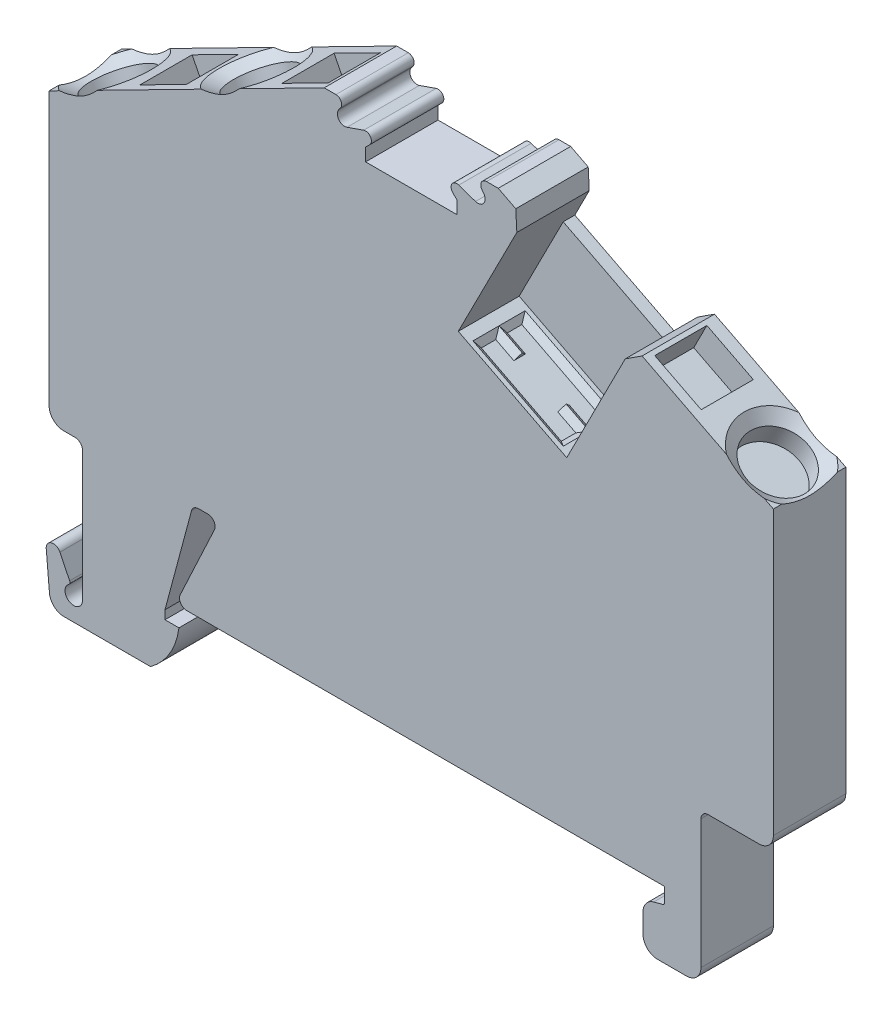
from build123d import *

# Parameters (mm, degrees)
BOSS_EXTRUDE1_DEPTH     = 5
BOSS_EXTRUDE2_DEPTH     = 5
BOSS_EXTRUDE3_DEPTH     = 0.8
CUT_EXTRUDE1_DEPTH      = 3.6
CUT_EXTRUDE2_DEPTH      = 3.6
CUT_EXTRUDE3_DEPTH      = 3.6
CUT_EXTRUDE4_DEPTH      = 3.5
CUT_EXTRUDE4_DEPTH_BACK = 3.5
CUT_EXTRUDE5_DEPTH      = 1.7
CUT_EXTRUDE5_DEPTH_BACK = 1.7
SKETCH11_W              = 1
SKETCH11_H              = 0.4
BOSS_EXTRUDE4_DEPTH     = 5


with BuildPart() as part:
    # Sketch1 → Boss-Extrude1 (new body)
    with BuildSketch(Plane.XY):
        with BuildLine():
            Line((-25, 10), (25, 10))
            Line((25, 10), (25, 26.322216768))
            Line((25, 26.322216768), (15.936493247, 30.940304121))
            Line((15.936493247, 30.940304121), (14.774397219, 30.185630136))
            Line((14.774397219, 30.185630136), (10.733881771, 22.255672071))
            Line((10.733881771, 22.255672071), (3.249426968, 26.069192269))
            Line((3.249426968, 26.069192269), (7.289942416, 33.999150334))
            Line((7.289942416, 33.999150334), (7.217423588, 35.382892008))
            Line((7.217423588, 35.382892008), (6.006280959, 36))
            Line((6.006280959, 36), (5.2, 36))
            ThreePointArc((5.2, 36), (4.842229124, 35.778885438), (4.88, 35.36))
            Line((4.88, 35.36), (5, 35.2))
            ThreePointArc((5, 35.2), (5.003880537, 34.605244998), (4.436272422, 34.427566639))
            Line((4.436272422, 34.427566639), (3.280982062, 34.827946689))
            ThreePointArc((3.280982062, 34.827946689), (2.810992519, 34.662306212), (2.867157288, 34.167157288))
            Line((2.867157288, 34.167157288), (3.15, 33.884314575))
            Line((3.15, 33.884314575), (3.15, 33))
            Line((3.15, 33), (-3.15, 33))
            Line((-3.15, 33), (-3.15, 33.884314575))
            Line((-3.15, 33.884314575), (-2.867157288, 34.167157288))
            ThreePointArc((-2.867157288, 34.167157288), (-2.810992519, 34.662306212), (-3.280982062, 34.827946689))
            Line((-3.280982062, 34.827946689), (-4.436272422, 34.427566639))
            ThreePointArc((-4.436272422, 34.427566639), (-5.003880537, 34.605244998), (-5, 35.2))
            Line((-5, 35.2), (-4.88, 35.36))
            ThreePointArc((-4.88, 35.36), (-4.842229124, 35.778885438), (-5.2, 36))
            Line((-5.2, 36), (-6.006280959, 36))
            Line((-6.006280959, 36), (-25, 26.322216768))
            Line((-25, 26.322216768), (-25, 10))
        make_face()
    extrude(amount=BOSS_EXTRUDE1_DEPTH)

    # Sketch2 → Boss-Extrude2 (add)
    with BuildSketch(Plane.XY):
        with BuildLine():
            Line((-25.198097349, -1.143577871), (-24.975563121, -3.687155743))
            ThreePointArc((-24.975563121, -3.687155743), (-24.65495863, -4.337277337), (-23.979368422, -4.6))
            Line((-23.979368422, -4.6), (-18.001786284, -4.6))
            ThreePointArc((-18.001786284, -4.6), (-16.675313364, -3.154986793), (-16.03764764, -1.3))
            Line((-16.03764764, -1.3), (-17, -1.3))
            Line((-17, -1.3), (-17, -0.7))
            Line((-17, -0.7), (-15.170065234, 6.129409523))
            ThreePointArc((-15.170065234, 6.129409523), (-14.991483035, 6.39667667), (-14.687102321, 6.5))
            Line((-14.687102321, 6.5), (-14.038685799, 6.5))
            ThreePointArc((-14.038685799, 6.5), (-13.616990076, 6.268649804), (-13.585531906, 5.788690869))
            Line((-13.585531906, 5.788690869), (-15.953153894, 0.711309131))
            ThreePointArc((-15.953153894, 0.711309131), (-15.921695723, 0.231350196), (-15.5, 0))
            Line((-15.5, 0), (17.5, 0))
            Line((17.5, 0), (17.5, -0.946534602))
            ThreePointArc((17.5, -0.946534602), (17.458670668, -1.068286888), (17.351763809, -1.139719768))
            Line((17.351763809, -1.139719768), (16.741180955, -1.30332495))
            ThreePointArc((16.741180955, -1.30332495), (16.20664666, -1.660489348), (16, -2.269250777))
            Line((16, -2.269250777), (16, -3.6))
            ThreePointArc((16, -3.6), (16.292893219, -4.307106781), (17, -4.6))
            Line((17, -4.6), (19, -4.6))
            ThreePointArc((19, -4.6), (19.707106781, -4.307106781), (20, -3.6))
            Line((20, -3.6), (20, 5.3))
            ThreePointArc((20, 5.3), (20.146446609, 5.653553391), (20.5, 5.8))
            Line((20.5, 5.8), (24, 5.8))
            ThreePointArc((24, 5.8), (24.707106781, 6.092893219), (25, 6.8))
            Line((25, 6.8), (25, 10))
            Line((25, 10), (-25, 10))
            Line((-25, 10), (-25, 7.5))
            ThreePointArc((-25, 7.5), (-24.707106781, 6.792893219), (-24, 6.5))
            Line((-24, 6.5), (-23.2, 6.5))
            ThreePointArc((-23.2, 6.5), (-22.846446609, 6.353553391), (-22.7, 6))
            Line((-22.7, 6), (-22.7, -3))
            ThreePointArc((-22.7, -3), (-23.575052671, -3.53324106), (-23.647820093, -2.511102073))
            ThreePointArc((-23.647820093, -2.511102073), (-23.570035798, -2.397844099), (-23.583678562, -2.261126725))
            Line((-23.583678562, -2.261126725), (-24.249796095, -0.882476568))
            ThreePointArc((-24.249796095, -0.882476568), (-24.832728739, -0.617938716), (-25.198097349, -1.143577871))
        make_face()
    extrude(amount=BOSS_EXTRUDE2_DEPTH)

    # Sketch3 → Boss-Extrude3 (add)
    with BuildSketch(Plane.XY):
        Polygon((3.249426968, 26.069192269), (10.733881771, 22.255672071), (13.77561812, 28.225415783), (6.291163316, 32.038935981), align=None)
    extrude(amount=BOSS_EXTRUDE3_DEPTH)

    # Sketch4 → Cut-Revolve1 (revolve, cut)
    with BuildSketch(Plane.XY.offset(2.5), mode=Mode.PRIVATE) as cut_revolve1_sk:
        Polygon((-13.180770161, 32.344415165), (-10.596851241, 33.660987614), (-11.03726216, 32.7631913), (-10.40167546, 31.515782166), (-12.272789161, 30.562402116), align=None)
    revolve(cut_revolve1_sk.sketch.rotate(Axis((-12.272789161, 30.562402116, 2.5), (-0.45399049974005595, 0.8910065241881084, 0)), 180), axis=Axis((-12.272789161, 30.562402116, 2.5), (-0.45399049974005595, 0.8910065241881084, 0)), mode=Mode.SUBTRACT)

    # Sketch5 → Cut-Revolve2 (revolve, cut)
    with BuildSketch(Plane.XY.offset(2.5), mode=Mode.PRIVATE) as cut_revolve2_sk:
        Polygon((-22.981841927, 27.350519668), (-20.397923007, 28.667092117), (-20.838333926, 27.769295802), (-20.202747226, 26.521886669), (-22.073860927, 25.568506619), align=None)
    revolve(cut_revolve2_sk.sketch.rotate(Axis((-22.073860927, 25.568506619, 2.5), (-0.4539904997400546, 0.8910065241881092, 0)), 180), axis=Axis((-22.073860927, 25.568506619, 2.5), (-0.4539904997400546, 0.8910065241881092, 0)), mode=Mode.SUBTRACT)

    # Sketch6 → Cut-Revolve3 (revolve, cut)
    with BuildSketch(Plane.XY.offset(2.5), mode=Mode.PRIVATE) as cut_revolve3_sk:
        Polygon((23.070942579, 27.305120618), (25.654861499, 25.988548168), (24.66966198, 25.817136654), (24.034075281, 24.56972752), (22.16296158, 25.523107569), align=None)
    revolve(cut_revolve3_sk.sketch.rotate(Axis((22.16296158, 25.523107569, 2.5), (0.453990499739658, 0.8910065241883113, 0)), 180), axis=Axis((22.16296158, 25.523107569, 2.5), (0.453990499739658, 0.8910065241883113, 0)), mode=Mode.SUBTRACT)

    # Sketch7 → Cut-Extrude1 (cut)
    with BuildSketch(Plane.XY.offset(0.8)):
        Polygon((-9.527643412, 34.205776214), (-8.619662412, 32.423763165), (-5.412038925, 34.058128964), (-6.320019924, 35.840142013), align=None)
    extrude(amount=CUT_EXTRUDE1_DEPTH, mode=Mode.SUBTRACT)

    # Sketch8 → Cut-Extrude2 (cut)
    with BuildSketch(Plane.XY.offset(0.8)):
        Polygon((-19.328715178, 29.211880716), (-18.420734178, 27.429867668), (-15.213110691, 29.064233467), (-16.121091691, 30.846246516), align=None)
    extrude(amount=CUT_EXTRUDE2_DEPTH, mode=Mode.SUBTRACT)

    # Sketch9 → Cut-Extrude3 (cut)
    with BuildSketch(Plane.XY.offset(0.8)):
        Polygon((15.302211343, 29.018834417), (18.509834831, 27.384468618), (19.41781583, 29.166481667), (16.210192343, 30.800847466), align=None)
    extrude(amount=CUT_EXTRUDE3_DEPTH, mode=Mode.SUBTRACT)

    # Sketch10 → Cut-Extrude4 (cut, two sides: drawn at the far end of the back side and taken through both)
    with BuildSketch(Plane(origin=(-4.134185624, 2.106472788, 0), x_dir=(0, 0, -1), z_dir=(0.8910065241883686, -0.4539904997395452, 0)).offset(-CUT_EXTRUDE4_DEPTH_BACK)):
        Polygon((-4.7, 25.203029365), (-4.7, 24.703029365), (-4.3, 24.303029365), (-3.3, 24.303029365), (-2.9, 24.703029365), (-2.5, 24.303029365), (-1.5, 24.303029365), (-1.1, 24.703029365), (-1.1, 25.203029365), align=None)
    extrude(amount=CUT_EXTRUDE4_DEPTH + CUT_EXTRUDE4_DEPTH_BACK, mode=Mode.SUBTRACT)

    # Sketch11 → Cut-Extrude5 (cut, two sides: drawn at the far end of the back side and taken through both)
    with BuildSketch(Plane(origin=(-4.134185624, 2.106472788, 0), x_dir=(0, 0, -1), z_dir=(0.8910065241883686, -0.4539904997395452, 0)).offset(-CUT_EXTRUDE5_DEPTH_BACK)):
        with Locations((-2.9, 24.503029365)):
            Rectangle(SKETCH11_W, SKETCH11_H)
    extrude(amount=CUT_EXTRUDE5_DEPTH + CUT_EXTRUDE5_DEPTH_BACK, mode=Mode.SUBTRACT)

    # Sketch12 → Boss-Extrude4 (add)
    with BuildSketch(Plane.XY):
        Polygon((3.508241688, 24.814993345), (9.745287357, 21.637059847), (10.199277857, 22.528066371), (9.661279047, 22.353259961), (4.137038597, 25.168001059), (3.962232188, 25.705999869), align=None)
    extrude(amount=BOSS_EXTRUDE4_DEPTH)


solid = part.part
